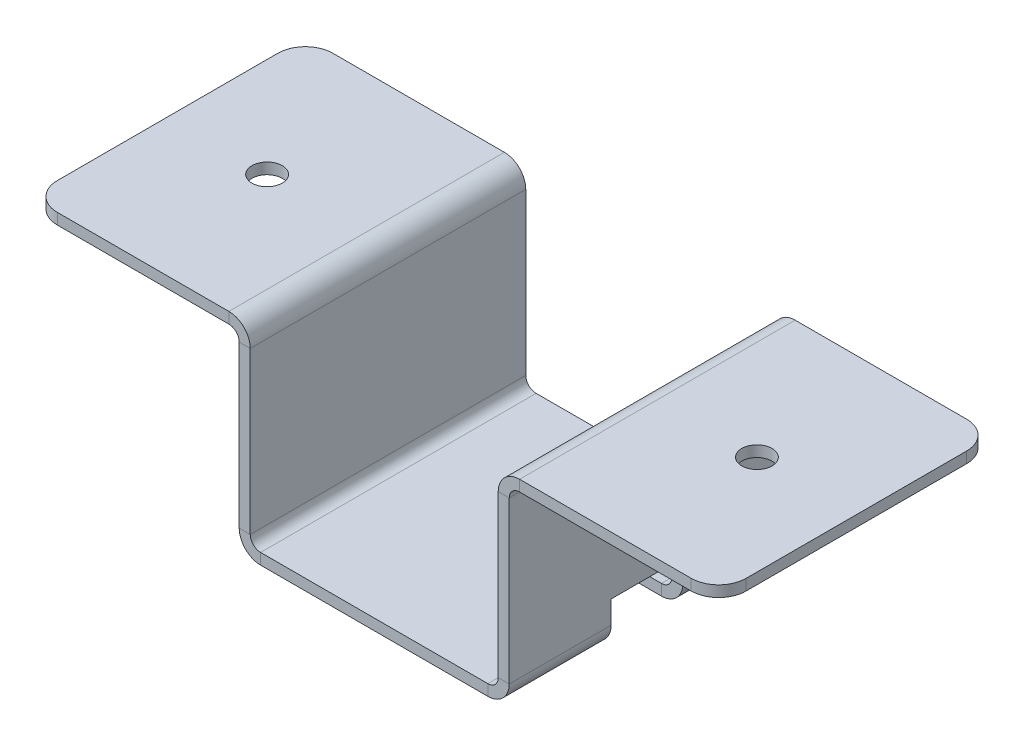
ISO-10303-21;
HEADER;
FILE_DESCRIPTION(('STEP AP214'),'2;1');
FILE_NAME('part.step','',(''),(''),'','','');
FILE_SCHEMA(('AUTOMOTIVE_DESIGN { 1 0 10303 214 1 1 1 1 }'));
ENDSEC;
DATA;
#1=APPLICATION_CONTEXT('core data for automotive mechanical design processes');
#2=APPLICATION_PROTOCOL_DEFINITION('international standard','automotive_design',2000,#1);
#3=PRODUCT_CONTEXT('',#1,'mechanical');
#4=PRODUCT('Part','Part','',(#3));
#5=PRODUCT_RELATED_PRODUCT_CATEGORY('part','',(#4));
#6=PRODUCT_DEFINITION_FORMATION('','',#4);
#7=PRODUCT_DEFINITION_CONTEXT('part definition',#1,'design');
#8=PRODUCT_DEFINITION('design','',#6,#7);
#9=PRODUCT_DEFINITION_SHAPE('','',#8);
#10=(LENGTH_UNIT() NAMED_UNIT(*) SI_UNIT(.MILLI.,.METRE.));
#11=(NAMED_UNIT(*) PLANE_ANGLE_UNIT() SI_UNIT($,.RADIAN.));
#12=(NAMED_UNIT(*) SI_UNIT($,.STERADIAN.) SOLID_ANGLE_UNIT());
#13=UNCERTAINTY_MEASURE_WITH_UNIT(LENGTH_MEASURE(1.E-05),#10,'distance_accuracy_value','');
#14=(GEOMETRIC_REPRESENTATION_CONTEXT(3) GLOBAL_UNCERTAINTY_ASSIGNED_CONTEXT((#13)) GLOBAL_UNIT_ASSIGNED_CONTEXT((#10,
#11,#12)) REPRESENTATION_CONTEXT('',''));
#15=CARTESIAN_POINT('',(0.,0.,0.));
#16=DIRECTION('',(0.,0.,1.));
#17=DIRECTION('',(1.,0.,0.));
#18=AXIS2_PLACEMENT_3D('',#15,#16,#17);
#19=CARTESIAN_POINT('',(16.5,6.,18.5));
#20=DIRECTION('',(0.,0.,-1.));
#21=DIRECTION('',(-1.,0.,0.));
#22=AXIS2_PLACEMENT_3D('',#19,#20,#21);
#23=PLANE('',#22);
#24=DIRECTION('',(0.,1.,0.));
#25=VECTOR('',#24,1.);
#26=CARTESIAN_POINT('',(22.5,0.,18.5));
#27=LINE('',#26,#25);
#28=CARTESIAN_POINT('',(22.5,1.88,18.5));
#29=VERTEX_POINT('',#28);
#30=CARTESIAN_POINT('',(22.5,6.,18.5));
#31=VERTEX_POINT('',#30);
#32=EDGE_CURVE('E289',#29,#31,#27,.T.);
#33=ORIENTED_EDGE('',*,*,#32,.F.);
#34=DIRECTION('',(1.,0.,0.));
#35=VECTOR('',#34,1.);
#36=CARTESIAN_POINT('',(22.5,1.88,18.5));
#37=LINE('',#36,#35);
#38=CARTESIAN_POINT('',(24.5,1.88,18.5));
#39=VERTEX_POINT('',#38);
#40=EDGE_CURVE('E528',#29,#39,#37,.T.);
#41=ORIENTED_EDGE('',*,*,#40,.T.);
#42=DIRECTION('',(0.,1.,0.));
#43=VECTOR('',#42,1.);
#44=CARTESIAN_POINT('',(24.5,0.,18.5));
#45=LINE('',#44,#43);
#46=CARTESIAN_POINT('',(24.5,6.,18.5));
#47=VERTEX_POINT('',#46);
#48=EDGE_CURVE('E292',#39,#47,#45,.T.);
#49=ORIENTED_EDGE('',*,*,#48,.T.);
#50=DIRECTION('',(1.,0.,0.));
#51=VECTOR('',#50,1.);
#52=CARTESIAN_POINT('',(16.5,6.,18.5));
#53=LINE('',#52,#51);
#54=EDGE_CURVE('E281',#31,#47,#53,.T.);
#55=ORIENTED_EDGE('',*,*,#54,.F.);
#56=EDGE_LOOP('',(#33,#41,#49,#55));
#57=FACE_BOUND('',#56,.T.);
#58=ADVANCED_FACE('F43',(#57),#23,.F.);
#59=DIRECTION('',(1.,0.,0.));
#60=VECTOR('',#59,1.);
#61=CARTESIAN_POINT('',(16.5,-2.,18.5));
#62=LINE('',#61,#60);
#63=CARTESIAN_POINT('',(16.5,-2.,18.5));
#64=VERTEX_POINT('',#63);
#65=CARTESIAN_POINT('',(20.62,-2.,18.5));
#66=VERTEX_POINT('',#65);
#67=EDGE_CURVE('E258',#64,#66,#62,.T.);
#68=ORIENTED_EDGE('',*,*,#67,.T.);
#69=DIRECTION('',(0.,1.,0.));
#70=VECTOR('',#69,1.);
#71=CARTESIAN_POINT('',(20.62,-2.,18.5));
#72=LINE('',#71,#70);
#73=CARTESIAN_POINT('',(20.62,0.,18.5));
#74=VERTEX_POINT('',#73);
#75=EDGE_CURVE('E526',#66,#74,#72,.T.);
#76=ORIENTED_EDGE('',*,*,#75,.T.);
#77=DIRECTION('',(1.,0.,0.));
#78=VECTOR('',#77,1.);
#79=CARTESIAN_POINT('',(-22.5,0.,18.5));
#80=LINE('',#79,#78);
#81=CARTESIAN_POINT('',(16.5,0.,18.5));
#82=VERTEX_POINT('',#81);
#83=EDGE_CURVE('E261',#82,#74,#80,.T.);
#84=ORIENTED_EDGE('',*,*,#83,.F.);
#85=DIRECTION('',(0.,-1.,0.));
#86=VECTOR('',#85,1.);
#87=CARTESIAN_POINT('',(16.5,6.,18.5));
#88=LINE('',#87,#86);
#89=EDGE_CURVE('E254',#82,#64,#88,.T.);
#90=ORIENTED_EDGE('',*,*,#89,.T.);
#91=EDGE_LOOP('',(#68,#76,#84,#90));
#92=FACE_BOUND('',#91,.T.);
#93=ADVANCED_FACE('F256',(#92),#23,.F.);
#94=CARTESIAN_POINT('',(16.5,6.,31.5));
#95=DIRECTION('',(0.,0.,1.));
#96=DIRECTION('',(1.,0.,0.));
#97=AXIS2_PLACEMENT_3D('',#94,#95,#96);
#98=PLANE('',#97);
#99=DIRECTION('',(-1.,0.,0.));
#100=VECTOR('',#99,1.);
#101=CARTESIAN_POINT('',(-22.5,0.,31.5));
#102=LINE('',#101,#100);
#103=CARTESIAN_POINT('',(20.62,0.,31.5));
#104=VERTEX_POINT('',#103);
#105=CARTESIAN_POINT('',(16.5,0.,31.5));
#106=VERTEX_POINT('',#105);
#107=EDGE_CURVE('E517',#104,#106,#102,.T.);
#108=ORIENTED_EDGE('',*,*,#107,.F.);
#109=DIRECTION('',(0.,-1.,0.));
#110=VECTOR('',#109,1.);
#111=CARTESIAN_POINT('',(20.62,0.,31.5));
#112=LINE('',#111,#110);
#113=CARTESIAN_POINT('',(20.62,-2.,31.5));
#114=VERTEX_POINT('',#113);
#115=EDGE_CURVE('E524',#104,#114,#112,.T.);
#116=ORIENTED_EDGE('',*,*,#115,.T.);
#117=DIRECTION('',(-1.,0.,0.));
#118=VECTOR('',#117,1.);
#119=CARTESIAN_POINT('',(16.5,-2.,31.5));
#120=LINE('',#119,#118);
#121=CARTESIAN_POINT('',(16.5,-2.,31.5));
#122=VERTEX_POINT('',#121);
#123=EDGE_CURVE('E279',#114,#122,#120,.T.);
#124=ORIENTED_EDGE('',*,*,#123,.T.);
#125=DIRECTION('',(0.,-1.,0.));
#126=VECTOR('',#125,1.);
#127=CARTESIAN_POINT('',(16.5,6.,31.5));
#128=LINE('',#127,#126);
#129=EDGE_CURVE('E264',#106,#122,#128,.T.);
#130=ORIENTED_EDGE('',*,*,#129,.F.);
#131=EDGE_LOOP('',(#108,#116,#124,#130));
#132=FACE_BOUND('',#131,.T.);
#133=ADVANCED_FACE('F695',(#132),#98,.F.);
#134=DIRECTION('',(0.,-1.,0.));
#135=VECTOR('',#134,1.);
#136=CARTESIAN_POINT('',(24.5,0.,31.5));
#137=LINE('',#136,#135);
#138=CARTESIAN_POINT('',(24.5,6.,31.5));
#139=VERTEX_POINT('',#138);
#140=CARTESIAN_POINT('',(24.5,1.88,31.5));
#141=VERTEX_POINT('',#140);
#142=EDGE_CURVE('E304',#139,#141,#137,.T.);
#143=ORIENTED_EDGE('',*,*,#142,.T.);
#144=DIRECTION('',(-1.,0.,0.));
#145=VECTOR('',#144,1.);
#146=CARTESIAN_POINT('',(24.5,1.88,31.5));
#147=LINE('',#146,#145);
#148=CARTESIAN_POINT('',(22.5,1.88,31.5));
#149=VERTEX_POINT('',#148);
#150=EDGE_CURVE('E522',#141,#149,#147,.T.);
#151=ORIENTED_EDGE('',*,*,#150,.T.);
#152=DIRECTION('',(0.,-1.,0.));
#153=VECTOR('',#152,1.);
#154=CARTESIAN_POINT('',(22.5,0.,31.5));
#155=LINE('',#154,#153);
#156=CARTESIAN_POINT('',(22.5,6.,31.5));
#157=VERTEX_POINT('',#156);
#158=EDGE_CURVE('E301',#157,#149,#155,.T.);
#159=ORIENTED_EDGE('',*,*,#158,.F.);
#160=DIRECTION('',(-1.,0.,0.));
#161=VECTOR('',#160,1.);
#162=CARTESIAN_POINT('',(16.5,6.,31.5));
#163=LINE('',#162,#161);
#164=EDGE_CURVE('E265',#139,#157,#163,.T.);
#165=ORIENTED_EDGE('',*,*,#164,.F.);
#166=EDGE_LOOP('',(#143,#151,#159,#165));
#167=FACE_BOUND('',#166,.T.);
#168=ADVANCED_FACE('F709',(#167),#98,.F.);
#169=CARTESIAN_POINT('',(20.62,1.88,50.));
#170=DIRECTION('',(0.,0.,-1.));
#171=DIRECTION('',(-1.,0.,0.));
#172=AXIS2_PLACEMENT_3D('',#169,#170,#171);
#173=CYLINDRICAL_SURFACE('',#172,3.88);
#174=CARTESIAN_POINT('',(20.62,1.88,31.5));
#175=DIRECTION('',(0.,0.,1.));
#176=DIRECTION('',(1.,0.,0.));
#177=AXIS2_PLACEMENT_3D('',#174,#175,#176);
#178=CIRCLE('',#177,3.88);
#179=EDGE_CURVE('E307',#141,#114,#178,.F.);
#180=ORIENTED_EDGE('',*,*,#179,.F.);
#181=DIRECTION('',(0.,0.,-1.));
#182=VECTOR('',#181,1.);
#183=CARTESIAN_POINT('',(24.5,1.88,50.));
#184=LINE('',#183,#182);
#185=CARTESIAN_POINT('',(24.5,1.88,50.));
#186=VERTEX_POINT('',#185);
#187=EDGE_CURVE('E454',#186,#141,#184,.T.);
#188=ORIENTED_EDGE('',*,*,#187,.F.);
#189=CARTESIAN_POINT('',(20.62,1.88,50.));
#190=DIRECTION('',(0.,0.,1.));
#191=DIRECTION('',(1.,0.,0.));
#192=AXIS2_PLACEMENT_3D('',#189,#190,#191);
#193=CIRCLE('',#192,3.88);
#194=CARTESIAN_POINT('',(20.62,-2.,50.));
#195=VERTEX_POINT('',#194);
#196=EDGE_CURVE('E333',#186,#195,#193,.F.);
#197=ORIENTED_EDGE('',*,*,#196,.T.);
#198=DIRECTION('',(0.,0.,-1.));
#199=VECTOR('',#198,1.);
#200=CARTESIAN_POINT('',(20.62,-2.,50.));
#201=LINE('',#200,#199);
#202=EDGE_CURVE('E457',#195,#114,#201,.T.);
#203=ORIENTED_EDGE('',*,*,#202,.T.);
#204=EDGE_LOOP('',(#180,#188,#197,#203));
#205=FACE_BOUND('',#204,.T.);
#206=ADVANCED_FACE('F606',(#205),#173,.T.);
#207=CARTESIAN_POINT('',(20.62,1.88,50.));
#208=DIRECTION('',(0.,0.,-1.));
#209=DIRECTION('',(-1.,0.,0.));
#210=AXIS2_PLACEMENT_3D('',#207,#208,#209);
#211=CYLINDRICAL_SURFACE('',#210,1.88);
#212=DIRECTION('',(0.,0.,-1.));
#213=VECTOR('',#212,1.);
#214=CARTESIAN_POINT('',(22.5,1.88,50.));
#215=LINE('',#214,#213);
#216=CARTESIAN_POINT('',(22.5,1.88,50.));
#217=VERTEX_POINT('',#216);
#218=EDGE_CURVE('E434',#217,#149,#215,.T.);
#219=ORIENTED_EDGE('',*,*,#218,.T.);
#220=CARTESIAN_POINT('',(20.62,1.88,31.5));
#221=DIRECTION('',(0.,0.,1.));
#222=DIRECTION('',(1.,0.,0.));
#223=AXIS2_PLACEMENT_3D('',#220,#221,#222);
#224=CIRCLE('',#223,1.88);
#225=EDGE_CURVE('E298',#149,#104,#224,.F.);
#226=ORIENTED_EDGE('',*,*,#225,.T.);
#227=DIRECTION('',(0.,0.,-1.));
#228=VECTOR('',#227,1.);
#229=CARTESIAN_POINT('',(20.62,0.,50.));
#230=LINE('',#229,#228);
#231=CARTESIAN_POINT('',(20.62,0.,50.));
#232=VERTEX_POINT('',#231);
#233=EDGE_CURVE('E430',#232,#104,#230,.T.);
#234=ORIENTED_EDGE('',*,*,#233,.F.);
#235=CARTESIAN_POINT('',(20.62,1.88,50.));
#236=DIRECTION('',(0.,0.,1.));
#237=DIRECTION('',(1.,0.,0.));
#238=AXIS2_PLACEMENT_3D('',#235,#236,#237);
#239=CIRCLE('',#238,1.88);
#240=EDGE_CURVE('E352',#217,#232,#239,.F.);
#241=ORIENTED_EDGE('',*,*,#240,.F.);
#242=EDGE_LOOP('',(#219,#226,#234,#241));
#243=FACE_BOUND('',#242,.T.);
#244=ADVANCED_FACE('F756',(#243),#211,.F.);
#245=CARTESIAN_POINT('',(26.38,35.,50.));
#246=DIRECTION('',(0.,0.,1.));
#247=DIRECTION('',(1.,0.,0.));
#248=AXIS2_PLACEMENT_3D('',#245,#246,#247);
#249=PLANE('',#248);
#250=DIRECTION('',(0.,-1.,0.));
#251=VECTOR('',#250,1.);
#252=CARTESIAN_POINT('',(26.38,35.,50.));
#253=LINE('',#252,#251);
#254=CARTESIAN_POINT('',(26.38,35.,50.));
#255=VERTEX_POINT('',#254);
#256=CARTESIAN_POINT('',(26.38,33.,50.));
#257=VERTEX_POINT('',#256);
#258=EDGE_CURVE('E511',#255,#257,#253,.T.);
#259=ORIENTED_EDGE('',*,*,#258,.F.);
#260=CARTESIAN_POINT('',(26.38,31.12,50.));
#261=DIRECTION('',(0.,0.,-1.));
#262=DIRECTION('',(-1.,0.,0.));
#263=AXIS2_PLACEMENT_3D('',#260,#261,#262);
#264=CIRCLE('',#263,3.88);
#265=CARTESIAN_POINT('',(22.5,31.12,50.));
#266=VERTEX_POINT('',#265);
#267=EDGE_CURVE('E346',#255,#266,#264,.F.);
#268=ORIENTED_EDGE('',*,*,#267,.T.);
#269=DIRECTION('',(-1.,0.,0.));
#270=VECTOR('',#269,1.);
#271=CARTESIAN_POINT('',(24.5,31.12,50.));
#272=LINE('',#271,#270);
#273=CARTESIAN_POINT('',(24.5,31.12,50.));
#274=VERTEX_POINT('',#273);
#275=EDGE_CURVE('E509',#274,#266,#272,.T.);
#276=ORIENTED_EDGE('',*,*,#275,.F.);
#277=CARTESIAN_POINT('',(26.38,31.12,50.));
#278=DIRECTION('',(0.,0.,1.));
#279=DIRECTION('',(1.,0.,0.));
#280=AXIS2_PLACEMENT_3D('',#277,#278,#279);
#281=CIRCLE('',#280,1.88);
#282=EDGE_CURVE('E339',#257,#274,#281,.T.);
#283=ORIENTED_EDGE('',*,*,#282,.F.);
#284=EDGE_LOOP('',(#259,#268,#276,#283));
#285=FACE_BOUND('',#284,.T.);
#286=ADVANCED_FACE('F588',(#285),#249,.T.);
#287=CARTESIAN_POINT('',(24.5,31.12,50.));
#288=DIRECTION('',(0.,0.,1.));
#289=DIRECTION('',(1.,0.,0.));
#290=AXIS2_PLACEMENT_3D('',#287,#288,#289);
#291=PLANE('',#290);
#292=DIRECTION('',(1.,0.,0.));
#293=VECTOR('',#292,1.);
#294=CARTESIAN_POINT('',(22.5,33.,50.));
#295=LINE('',#294,#293);
#296=CARTESIAN_POINT('',(57.5,33.,50.));
#297=VERTEX_POINT('',#296);
#298=EDGE_CURVE('E342',#297,#257,#295,.F.);
#299=ORIENTED_EDGE('',*,*,#298,.F.);
#300=DIRECTION('',(0.,-1.,0.));
#301=VECTOR('',#300,1.);
#302=CARTESIAN_POINT('',(57.5,31.12,50.));
#303=LINE('',#302,#301);
#304=CARTESIAN_POINT('',(57.5,35.,50.));
#305=VERTEX_POINT('',#304);
#306=EDGE_CURVE('E11',#297,#305,#303,.F.);
#307=ORIENTED_EDGE('',*,*,#306,.T.);
#308=DIRECTION('',(-1.,0.,0.));
#309=VECTOR('',#308,1.);
#310=CARTESIAN_POINT('',(22.5,35.,50.));
#311=LINE('',#310,#309);
#312=EDGE_CURVE('E344',#305,#255,#311,.T.);
#313=ORIENTED_EDGE('',*,*,#312,.T.);
#314=ORIENTED_EDGE('',*,*,#258,.T.);
#315=EDGE_LOOP('',(#299,#307,#313,#314));
#316=FACE_BOUND('',#315,.T.);
#317=ADVANCED_FACE('F580',(#316),#291,.T.);
#318=CARTESIAN_POINT('',(22.5,31.12,0.));
#319=DIRECTION('',(0.,0.,-1.));
#320=DIRECTION('',(-1.,0.,0.));
#321=AXIS2_PLACEMENT_3D('',#318,#319,#320);
#322=PLANE('',#321);
#323=DIRECTION('',(1.,0.,0.));
#324=VECTOR('',#323,1.);
#325=CARTESIAN_POINT('',(22.5,31.12,0.));
#326=LINE('',#325,#324);
#327=CARTESIAN_POINT('',(22.5,31.12,0.));
#328=VERTEX_POINT('',#327);
#329=CARTESIAN_POINT('',(24.5,31.12,0.));
#330=VERTEX_POINT('',#329);
#331=EDGE_CURVE('E507',#328,#330,#326,.T.);
#332=ORIENTED_EDGE('',*,*,#331,.F.);
#333=CARTESIAN_POINT('',(26.38,31.12,0.));
#334=DIRECTION('',(0.,0.,-1.));
#335=DIRECTION('',(-1.,0.,0.));
#336=AXIS2_PLACEMENT_3D('',#333,#334,#335);
#337=CIRCLE('',#336,3.88);
#338=CARTESIAN_POINT('',(26.38,35.,0.));
#339=VERTEX_POINT('',#338);
#340=EDGE_CURVE('E398',#339,#328,#337,.F.);
#341=ORIENTED_EDGE('',*,*,#340,.F.);
#342=DIRECTION('',(0.,1.,0.));
#343=VECTOR('',#342,1.);
#344=CARTESIAN_POINT('',(26.38,33.,0.));
#345=LINE('',#344,#343);
#346=CARTESIAN_POINT('',(26.38,33.,0.));
#347=VERTEX_POINT('',#346);
#348=EDGE_CURVE('E504',#347,#339,#345,.T.);
#349=ORIENTED_EDGE('',*,*,#348,.F.);
#350=CARTESIAN_POINT('',(26.38,31.12,0.));
#351=DIRECTION('',(0.,0.,1.));
#352=DIRECTION('',(1.,0.,0.));
#353=AXIS2_PLACEMENT_3D('',#350,#351,#352);
#354=CIRCLE('',#353,1.88);
#355=EDGE_CURVE('E391',#347,#330,#354,.T.);
#356=ORIENTED_EDGE('',*,*,#355,.T.);
#357=EDGE_LOOP('',(#332,#341,#349,#356));
#358=FACE_BOUND('',#357,.T.);
#359=ADVANCED_FACE('F817',(#358),#322,.T.);
#360=CARTESIAN_POINT('',(26.38,33.,0.));
#361=DIRECTION('',(0.,0.,-1.));
#362=DIRECTION('',(-1.,0.,0.));
#363=AXIS2_PLACEMENT_3D('',#360,#361,#362);
#364=PLANE('',#363);
#365=DIRECTION('',(0.,-1.,0.));
#366=VECTOR('',#365,1.);
#367=CARTESIAN_POINT('',(22.5,0.,0.));
#368=LINE('',#367,#366);
#369=CARTESIAN_POINT('',(22.5,1.88,0.));
#370=VERTEX_POINT('',#369);
#371=EDGE_CURVE('E401',#328,#370,#368,.T.);
#372=ORIENTED_EDGE('',*,*,#371,.F.);
#373=ORIENTED_EDGE('',*,*,#331,.T.);
#374=DIRECTION('',(0.,1.,0.));
#375=VECTOR('',#374,1.);
#376=CARTESIAN_POINT('',(24.5,0.,0.));
#377=LINE('',#376,#375);
#378=CARTESIAN_POINT('',(24.5,1.88,0.));
#379=VERTEX_POINT('',#378);
#380=EDGE_CURVE('E388',#330,#379,#377,.F.);
#381=ORIENTED_EDGE('',*,*,#380,.T.);
#382=DIRECTION('',(-1.,0.,0.));
#383=VECTOR('',#382,1.);
#384=CARTESIAN_POINT('',(24.5,1.88,0.));
#385=LINE('',#384,#383);
#386=EDGE_CURVE('E494',#379,#370,#385,.T.);
#387=ORIENTED_EDGE('',*,*,#386,.T.);
#388=EDGE_LOOP('',(#372,#373,#381,#387));
#389=FACE_BOUND('',#388,.T.);
#390=ADVANCED_FACE('F814',(#389),#364,.T.);
#391=CARTESIAN_POINT('',(22.5,1.88,50.));
#392=DIRECTION('',(0.,0.,1.));
#393=DIRECTION('',(1.,0.,0.));
#394=AXIS2_PLACEMENT_3D('',#391,#392,#393);
#395=PLANE('',#394);
#396=DIRECTION('',(1.,0.,0.));
#397=VECTOR('',#396,1.);
#398=CARTESIAN_POINT('',(22.5,1.88,50.));
#399=LINE('',#398,#397);
#400=EDGE_CURVE('E502',#217,#186,#399,.T.);
#401=ORIENTED_EDGE('',*,*,#400,.F.);
#402=ORIENTED_EDGE('',*,*,#240,.T.);
#403=DIRECTION('',(0.,1.,0.));
#404=VECTOR('',#403,1.);
#405=CARTESIAN_POINT('',(20.62,-2.,50.));
#406=LINE('',#405,#404);
#407=EDGE_CURVE('E500',#195,#232,#406,.T.);
#408=ORIENTED_EDGE('',*,*,#407,.F.);
#409=ORIENTED_EDGE('',*,*,#196,.F.);
#410=EDGE_LOOP('',(#401,#402,#408,#409));
#411=FACE_BOUND('',#410,.T.);
#412=ADVANCED_FACE('F607',(#411),#395,.T.);
#413=CARTESIAN_POINT('',(20.62,-2.,50.));
#414=DIRECTION('',(0.,0.,1.));
#415=DIRECTION('',(1.,0.,0.));
#416=AXIS2_PLACEMENT_3D('',#413,#414,#415);
#417=PLANE('',#416);
#418=DIRECTION('',(0.,-1.,0.));
#419=VECTOR('',#418,1.);
#420=CARTESIAN_POINT('',(22.5,0.,50.));
#421=LINE('',#420,#419);
#422=EDGE_CURVE('E349',#266,#217,#421,.T.);
#423=ORIENTED_EDGE('',*,*,#422,.T.);
#424=ORIENTED_EDGE('',*,*,#400,.T.);
#425=DIRECTION('',(0.,1.,0.));
#426=VECTOR('',#425,1.);
#427=CARTESIAN_POINT('',(24.5,0.,50.));
#428=LINE('',#427,#426);
#429=EDGE_CURVE('E336',#274,#186,#428,.F.);
#430=ORIENTED_EDGE('',*,*,#429,.F.);
#431=ORIENTED_EDGE('',*,*,#275,.T.);
#432=EDGE_LOOP('',(#423,#424,#430,#431));
#433=FACE_BOUND('',#432,.T.);
#434=ADVANCED_FACE('F598',(#433),#417,.T.);
#435=CARTESIAN_POINT('',(20.62,0.,0.));
#436=DIRECTION('',(0.,0.,-1.));
#437=DIRECTION('',(-1.,0.,0.));
#438=AXIS2_PLACEMENT_3D('',#435,#436,#437);
#439=PLANE('',#438);
#440=DIRECTION('',(0.,-1.,0.));
#441=VECTOR('',#440,1.);
#442=CARTESIAN_POINT('',(20.62,0.,0.));
#443=LINE('',#442,#441);
#444=CARTESIAN_POINT('',(20.62,0.,0.));
#445=VERTEX_POINT('',#444);
#446=CARTESIAN_POINT('',(20.62,-2.,0.));
#447=VERTEX_POINT('',#446);
#448=EDGE_CURVE('E497',#445,#447,#443,.T.);
#449=ORIENTED_EDGE('',*,*,#448,.F.);
#450=CARTESIAN_POINT('',(20.62,1.88,0.));
#451=DIRECTION('',(0.,0.,1.));
#452=DIRECTION('',(1.,0.,0.));
#453=AXIS2_PLACEMENT_3D('',#450,#451,#452);
#454=CIRCLE('',#453,1.88);
#455=EDGE_CURVE('E404',#370,#445,#454,.F.);
#456=ORIENTED_EDGE('',*,*,#455,.F.);
#457=ORIENTED_EDGE('',*,*,#386,.F.);
#458=CARTESIAN_POINT('',(20.62,1.88,0.));
#459=DIRECTION('',(0.,0.,1.));
#460=DIRECTION('',(1.,0.,0.));
#461=AXIS2_PLACEMENT_3D('',#458,#459,#460);
#462=CIRCLE('',#461,3.88);
#463=EDGE_CURVE('E385',#379,#447,#462,.F.);
#464=ORIENTED_EDGE('',*,*,#463,.T.);
#465=EDGE_LOOP('',(#449,#456,#457,#464));
#466=FACE_BOUND('',#465,.T.);
#467=ADVANCED_FACE('F726',(#466),#439,.T.);
#468=CARTESIAN_POINT('',(24.5,1.88,0.));
#469=DIRECTION('',(0.,0.,-1.));
#470=DIRECTION('',(-1.,0.,0.));
#471=AXIS2_PLACEMENT_3D('',#468,#469,#470);
#472=PLANE('',#471);
#473=DIRECTION('',(-1.,0.,0.));
#474=VECTOR('',#473,1.);
#475=CARTESIAN_POINT('',(-22.5,0.,0.));
#476=LINE('',#475,#474);
#477=CARTESIAN_POINT('',(-20.62,0.,0.));
#478=VERTEX_POINT('',#477);
#479=EDGE_CURVE('E407',#445,#478,#476,.T.);
#480=ORIENTED_EDGE('',*,*,#479,.F.);
#481=ORIENTED_EDGE('',*,*,#448,.T.);
#482=DIRECTION('',(1.,0.,0.));
#483=VECTOR('',#482,1.);
#484=CARTESIAN_POINT('',(-22.5,-2.,0.));
#485=LINE('',#484,#483);
#486=CARTESIAN_POINT('',(-20.62,-2.,0.));
#487=VERTEX_POINT('',#486);
#488=EDGE_CURVE('E382',#447,#487,#485,.F.);
#489=ORIENTED_EDGE('',*,*,#488,.T.);
#490=DIRECTION('',(0.,1.,0.));
#491=VECTOR('',#490,1.);
#492=CARTESIAN_POINT('',(-20.62,-2.,0.));
#493=LINE('',#492,#491);
#494=EDGE_CURVE('E486',#487,#478,#493,.T.);
#495=ORIENTED_EDGE('',*,*,#494,.T.);
#496=EDGE_LOOP('',(#480,#481,#489,#495));
#497=FACE_BOUND('',#496,.T.);
#498=ADVANCED_FACE('F730',(#497),#472,.T.);
#499=CARTESIAN_POINT('',(-20.62,0.,50.));
#500=DIRECTION('',(0.,0.,1.));
#501=DIRECTION('',(1.,0.,0.));
#502=AXIS2_PLACEMENT_3D('',#499,#500,#501);
#503=PLANE('',#502);
#504=DIRECTION('',(0.,-1.,0.));
#505=VECTOR('',#504,1.);
#506=CARTESIAN_POINT('',(-20.62,0.,50.));
#507=LINE('',#506,#505);
#508=CARTESIAN_POINT('',(-20.62,0.,50.));
#509=VERTEX_POINT('',#508);
#510=CARTESIAN_POINT('',(-20.62,-2.,50.));
#511=VERTEX_POINT('',#510);
#512=EDGE_CURVE('E492',#509,#511,#507,.T.);
#513=ORIENTED_EDGE('',*,*,#512,.F.);
#514=CARTESIAN_POINT('',(-20.62,1.88,50.));
#515=DIRECTION('',(0.,0.,1.));
#516=DIRECTION('',(1.,0.,0.));
#517=AXIS2_PLACEMENT_3D('',#514,#515,#516);
#518=CIRCLE('',#517,1.88);
#519=CARTESIAN_POINT('',(-22.5,1.88,50.));
#520=VERTEX_POINT('',#519);
#521=EDGE_CURVE('E358',#509,#520,#518,.F.);
#522=ORIENTED_EDGE('',*,*,#521,.T.);
#523=DIRECTION('',(1.,0.,0.));
#524=VECTOR('',#523,1.);
#525=CARTESIAN_POINT('',(-24.5,1.88,50.));
#526=LINE('',#525,#524);
#527=CARTESIAN_POINT('',(-24.5,1.88,50.));
#528=VERTEX_POINT('',#527);
#529=EDGE_CURVE('E490',#528,#520,#526,.T.);
#530=ORIENTED_EDGE('',*,*,#529,.F.);
#531=CARTESIAN_POINT('',(-20.62,1.88,50.));
#532=DIRECTION('',(0.,0.,1.));
#533=DIRECTION('',(1.,0.,0.));
#534=AXIS2_PLACEMENT_3D('',#531,#532,#533);
#535=CIRCLE('',#534,3.88);
#536=EDGE_CURVE('E327',#511,#528,#535,.F.);
#537=ORIENTED_EDGE('',*,*,#536,.F.);
#538=EDGE_LOOP('',(#513,#522,#530,#537));
#539=FACE_BOUND('',#538,.T.);
#540=ADVANCED_FACE('F622',(#539),#503,.T.);
#541=CARTESIAN_POINT('',(-24.5,1.88,50.));
#542=DIRECTION('',(0.,0.,1.));
#543=DIRECTION('',(1.,0.,0.));
#544=AXIS2_PLACEMENT_3D('',#541,#542,#543);
#545=PLANE('',#544);
#546=DIRECTION('',(-1.,0.,0.));
#547=VECTOR('',#546,1.);
#548=CARTESIAN_POINT('',(-22.5,0.,50.));
#549=LINE('',#548,#547);
#550=EDGE_CURVE('E355',#232,#509,#549,.T.);
#551=ORIENTED_EDGE('',*,*,#550,.T.);
#552=ORIENTED_EDGE('',*,*,#512,.T.);
#553=DIRECTION('',(1.,0.,0.));
#554=VECTOR('',#553,1.);
#555=CARTESIAN_POINT('',(-22.5,-2.,50.));
#556=LINE('',#555,#554);
#557=EDGE_CURVE('E330',#195,#511,#556,.F.);
#558=ORIENTED_EDGE('',*,*,#557,.F.);
#559=ORIENTED_EDGE('',*,*,#407,.T.);
#560=EDGE_LOOP('',(#551,#552,#558,#559));
#561=FACE_BOUND('',#560,.T.);
#562=ADVANCED_FACE('F613',(#561),#545,.T.);
#563=CARTESIAN_POINT('',(-22.5,1.88,0.));
#564=DIRECTION('',(0.,0.,-1.));
#565=DIRECTION('',(-1.,0.,0.));
#566=AXIS2_PLACEMENT_3D('',#563,#564,#565);
#567=PLANE('',#566);
#568=DIRECTION('',(-1.,0.,0.));
#569=VECTOR('',#568,1.);
#570=CARTESIAN_POINT('',(-22.5,1.88,0.));
#571=LINE('',#570,#569);
#572=CARTESIAN_POINT('',(-22.5,1.88,0.));
#573=VERTEX_POINT('',#572);
#574=CARTESIAN_POINT('',(-24.5,1.88,0.));
#575=VERTEX_POINT('',#574);
#576=EDGE_CURVE('E488',#573,#575,#571,.T.);
#577=ORIENTED_EDGE('',*,*,#576,.F.);
#578=CARTESIAN_POINT('',(-20.62,1.88,0.));
#579=DIRECTION('',(0.,0.,1.));
#580=DIRECTION('',(1.,0.,0.));
#581=AXIS2_PLACEMENT_3D('',#578,#579,#580);
#582=CIRCLE('',#581,1.88);
#583=EDGE_CURVE('E410',#478,#573,#582,.F.);
#584=ORIENTED_EDGE('',*,*,#583,.F.);
#585=ORIENTED_EDGE('',*,*,#494,.F.);
#586=CARTESIAN_POINT('',(-20.62,1.88,0.));
#587=DIRECTION('',(0.,0.,1.));
#588=DIRECTION('',(1.,0.,0.));
#589=AXIS2_PLACEMENT_3D('',#586,#587,#588);
#590=CIRCLE('',#589,3.88);
#591=EDGE_CURVE('E379',#487,#575,#590,.F.);
#592=ORIENTED_EDGE('',*,*,#591,.T.);
#593=EDGE_LOOP('',(#577,#584,#585,#592));
#594=FACE_BOUND('',#593,.T.);
#595=ADVANCED_FACE('F737',(#594),#567,.T.);
#596=CARTESIAN_POINT('',(-20.62,-2.,0.));
#597=DIRECTION('',(0.,0.,-1.));
#598=DIRECTION('',(-1.,0.,0.));
#599=AXIS2_PLACEMENT_3D('',#596,#597,#598);
#600=PLANE('',#599);
#601=DIRECTION('',(0.,1.,0.));
#602=VECTOR('',#601,1.);
#603=CARTESIAN_POINT('',(-22.5,0.,0.));
#604=LINE('',#603,#602);
#605=CARTESIAN_POINT('',(-22.5,31.12,0.));
#606=VERTEX_POINT('',#605);
#607=EDGE_CURVE('E413',#573,#606,#604,.T.);
#608=ORIENTED_EDGE('',*,*,#607,.F.);
#609=ORIENTED_EDGE('',*,*,#576,.T.);
#610=DIRECTION('',(0.,1.,0.));
#611=VECTOR('',#610,1.);
#612=CARTESIAN_POINT('',(-24.5,0.,0.));
#613=LINE('',#612,#611);
#614=CARTESIAN_POINT('',(-24.5,31.12,0.));
#615=VERTEX_POINT('',#614);
#616=EDGE_CURVE('E376',#575,#615,#613,.T.);
#617=ORIENTED_EDGE('',*,*,#616,.T.);
#618=DIRECTION('',(1.,0.,0.));
#619=VECTOR('',#618,1.);
#620=CARTESIAN_POINT('',(-24.5,31.12,0.));
#621=LINE('',#620,#619);
#622=EDGE_CURVE('E478',#615,#606,#621,.T.);
#623=ORIENTED_EDGE('',*,*,#622,.T.);
#624=EDGE_LOOP('',(#608,#609,#617,#623));
#625=FACE_BOUND('',#624,.T.);
#626=ADVANCED_FACE('F740',(#625),#600,.T.);
#627=CARTESIAN_POINT('',(-22.5,31.12,50.));
#628=DIRECTION('',(0.,0.,1.));
#629=DIRECTION('',(1.,0.,0.));
#630=AXIS2_PLACEMENT_3D('',#627,#628,#629);
#631=PLANE('',#630);
#632=DIRECTION('',(-1.,0.,0.));
#633=VECTOR('',#632,1.);
#634=CARTESIAN_POINT('',(-22.5,31.12,50.));
#635=LINE('',#634,#633);
#636=CARTESIAN_POINT('',(-22.5,31.12,50.));
#637=VERTEX_POINT('',#636);
#638=CARTESIAN_POINT('',(-24.5,31.12,50.));
#639=VERTEX_POINT('',#638);
#640=EDGE_CURVE('E484',#637,#639,#635,.T.);
#641=ORIENTED_EDGE('',*,*,#640,.F.);
#642=CARTESIAN_POINT('',(-26.38,31.12,50.));
#643=DIRECTION('',(0.,0.,-1.));
#644=DIRECTION('',(-1.,0.,0.));
#645=AXIS2_PLACEMENT_3D('',#642,#643,#644);
#646=CIRCLE('',#645,3.88);
#647=CARTESIAN_POINT('',(-26.38,35.,50.));
#648=VERTEX_POINT('',#647);
#649=EDGE_CURVE('E364',#637,#648,#646,.F.);
#650=ORIENTED_EDGE('',*,*,#649,.T.);
#651=DIRECTION('',(0.,1.,0.));
#652=VECTOR('',#651,1.);
#653=CARTESIAN_POINT('',(-26.38,33.,50.));
#654=LINE('',#653,#652);
#655=CARTESIAN_POINT('',(-26.38,33.,50.));
#656=VERTEX_POINT('',#655);
#657=EDGE_CURVE('E482',#656,#648,#654,.T.);
#658=ORIENTED_EDGE('',*,*,#657,.F.);
#659=CARTESIAN_POINT('',(-26.38,31.12,50.));
#660=DIRECTION('',(0.,0.,1.));
#661=DIRECTION('',(1.,0.,0.));
#662=AXIS2_PLACEMENT_3D('',#659,#660,#661);
#663=CIRCLE('',#662,1.88);
#664=EDGE_CURVE('E321',#639,#656,#663,.T.);
#665=ORIENTED_EDGE('',*,*,#664,.F.);
#666=EDGE_LOOP('',(#641,#650,#658,#665));
#667=FACE_BOUND('',#666,.T.);
#668=ADVANCED_FACE('F640',(#667),#631,.T.);
#669=CARTESIAN_POINT('',(-26.38,33.,50.));
#670=DIRECTION('',(0.,0.,1.));
#671=DIRECTION('',(1.,0.,0.));
#672=AXIS2_PLACEMENT_3D('',#669,#670,#671);
#673=PLANE('',#672);
#674=DIRECTION('',(0.,1.,0.));
#675=VECTOR('',#674,1.);
#676=CARTESIAN_POINT('',(-22.5,0.,50.));
#677=LINE('',#676,#675);
#678=EDGE_CURVE('E361',#520,#637,#677,.T.);
#679=ORIENTED_EDGE('',*,*,#678,.T.);
#680=ORIENTED_EDGE('',*,*,#640,.T.);
#681=DIRECTION('',(0.,1.,0.));
#682=VECTOR('',#681,1.);
#683=CARTESIAN_POINT('',(-24.5,0.,50.));
#684=LINE('',#683,#682);
#685=EDGE_CURVE('E324',#528,#639,#684,.T.);
#686=ORIENTED_EDGE('',*,*,#685,.F.);
#687=ORIENTED_EDGE('',*,*,#529,.T.);
#688=EDGE_LOOP('',(#679,#680,#686,#687));
#689=FACE_BOUND('',#688,.T.);
#690=ADVANCED_FACE('F631',(#689),#673,.T.);
#691=CARTESIAN_POINT('',(-26.38,35.,0.));
#692=DIRECTION('',(0.,0.,-1.));
#693=DIRECTION('',(-1.,0.,0.));
#694=AXIS2_PLACEMENT_3D('',#691,#692,#693);
#695=PLANE('',#694);
#696=DIRECTION('',(0.,-1.,0.));
#697=VECTOR('',#696,1.);
#698=CARTESIAN_POINT('',(-26.38,35.,0.));
#699=LINE('',#698,#697);
#700=CARTESIAN_POINT('',(-26.38,35.,0.));
#701=VERTEX_POINT('',#700);
#702=CARTESIAN_POINT('',(-26.38,33.,0.));
#703=VERTEX_POINT('',#702);
#704=EDGE_CURVE('E480',#701,#703,#699,.T.);
#705=ORIENTED_EDGE('',*,*,#704,.F.);
#706=CARTESIAN_POINT('',(-26.38,31.12,0.));
#707=DIRECTION('',(0.,0.,-1.));
#708=DIRECTION('',(-1.,0.,0.));
#709=AXIS2_PLACEMENT_3D('',#706,#707,#708);
#710=CIRCLE('',#709,3.88);
#711=EDGE_CURVE('E318',#606,#701,#710,.F.);
#712=ORIENTED_EDGE('',*,*,#711,.F.);
#713=ORIENTED_EDGE('',*,*,#622,.F.);
#714=CARTESIAN_POINT('',(-26.38,31.12,0.));
#715=DIRECTION('',(0.,0.,1.));
#716=DIRECTION('',(1.,0.,0.));
#717=AXIS2_PLACEMENT_3D('',#714,#715,#716);
#718=CIRCLE('',#717,1.88);
#719=EDGE_CURVE('E373',#615,#703,#718,.T.);
#720=ORIENTED_EDGE('',*,*,#719,.T.);
#721=EDGE_LOOP('',(#705,#712,#713,#720));
#722=FACE_BOUND('',#721,.T.);
#723=ADVANCED_FACE('F670',(#722),#695,.T.);
#724=CARTESIAN_POINT('',(-24.5,31.12,0.));
#725=DIRECTION('',(0.,0.,-1.));
#726=DIRECTION('',(-1.,0.,0.));
#727=AXIS2_PLACEMENT_3D('',#724,#725,#726);
#728=PLANE('',#727);
#729=DIRECTION('',(1.,0.,0.));
#730=VECTOR('',#729,1.);
#731=CARTESIAN_POINT('',(-22.5,33.,0.));
#732=LINE('',#731,#730);
#733=CARTESIAN_POINT('',(-57.5,33.,0.));
#734=VERTEX_POINT('',#733);
#735=EDGE_CURVE('E370',#703,#734,#732,.F.);
#736=ORIENTED_EDGE('',*,*,#735,.T.);
#737=DIRECTION('',(0.,1.,0.));
#738=VECTOR('',#737,1.);
#739=CARTESIAN_POINT('',(-57.5,31.12,0.));
#740=LINE('',#739,#738);
#741=CARTESIAN_POINT('',(-57.5,35.,0.));
#742=VERTEX_POINT('',#741);
#743=EDGE_CURVE('E545',#734,#742,#740,.T.);
#744=ORIENTED_EDGE('',*,*,#743,.T.);
#745=DIRECTION('',(-1.,0.,0.));
#746=VECTOR('',#745,1.);
#747=CARTESIAN_POINT('',(-22.5,35.,0.));
#748=LINE('',#747,#746);
#749=EDGE_CURVE('E313',#701,#742,#748,.T.);
#750=ORIENTED_EDGE('',*,*,#749,.F.);
#751=ORIENTED_EDGE('',*,*,#704,.T.);
#752=EDGE_LOOP('',(#736,#744,#750,#751));
#753=FACE_BOUND('',#752,.T.);
#754=ADVANCED_FACE('F666',(#753),#728,.T.);
#755=CARTESIAN_POINT('',(-22.5,35.,50.));
#756=DIRECTION('',(0.,-1.,0.));
#757=DIRECTION('',(0.,0.,-1.));
#758=AXIS2_PLACEMENT_3D('',#755,#756,#757);
#759=PLANE('',#758);
#760=CARTESIAN_POINT('',(-44.44,35.,25.));
#761=DIRECTION('',(0.,1.,0.));
#762=DIRECTION('',(0.,0.,1.));
#763=AXIS2_PLACEMENT_3D('',#760,#761,#762);
#764=CIRCLE('',#763,2.75);
#765=CARTESIAN_POINT('',(-44.44,35.,27.75));
#766=VERTEX_POINT('',#765);
#767=EDGE_CURVE('E795',#766,#766,#764,.T.);
#768=ORIENTED_EDGE('',*,*,#767,.F.);
#769=EDGE_LOOP('',(#768));
#770=FACE_BOUND('',#769,.T.);
#771=DIRECTION('',(0.,0.,-1.));
#772=VECTOR('',#771,1.);
#773=CARTESIAN_POINT('',(-62.5,35.,50.));
#774=LINE('',#773,#772);
#775=CARTESIAN_POINT('',(-62.5,35.,45.));
#776=VERTEX_POINT('',#775);
#777=CARTESIAN_POINT('',(-62.5,35.,5.));
#778=VERTEX_POINT('',#777);
#779=EDGE_CURVE('E475',#776,#778,#774,.T.);
#780=ORIENTED_EDGE('',*,*,#779,.F.);
#781=CARTESIAN_POINT('',(-57.5,35.,45.));
#782=DIRECTION('',(0.,-1.,0.));
#783=DIRECTION('',(0.,0.,-1.));
#784=AXIS2_PLACEMENT_3D('',#781,#782,#783);
#785=CIRCLE('',#784,5.);
#786=CARTESIAN_POINT('',(-57.5,35.,50.));
#787=VERTEX_POINT('',#786);
#788=EDGE_CURVE('E537',#776,#787,#785,.F.);
#789=ORIENTED_EDGE('',*,*,#788,.T.);
#790=DIRECTION('',(-1.,0.,0.));
#791=VECTOR('',#790,1.);
#792=CARTESIAN_POINT('',(-22.5,35.,50.));
#793=LINE('',#792,#791);
#794=EDGE_CURVE('E314',#648,#787,#793,.T.);
#795=ORIENTED_EDGE('',*,*,#794,.F.);
#796=DIRECTION('',(0.,0.,-1.));
#797=VECTOR('',#796,1.);
#798=CARTESIAN_POINT('',(-26.38,35.,50.));
#799=LINE('',#798,#797);
#800=EDGE_CURVE('E367',#648,#701,#799,.T.);
#801=ORIENTED_EDGE('',*,*,#800,.T.);
#802=ORIENTED_EDGE('',*,*,#749,.T.);
#803=CARTESIAN_POINT('',(-57.5,35.,5.));
#804=DIRECTION('',(0.,-1.,0.));
#805=DIRECTION('',(0.,0.,-1.));
#806=AXIS2_PLACEMENT_3D('',#803,#804,#805);
#807=CIRCLE('',#806,5.);
#808=EDGE_CURVE('E535',#742,#778,#807,.F.);
#809=ORIENTED_EDGE('',*,*,#808,.T.);
#810=EDGE_LOOP('',(#780,#789,#795,#801,#802,#809));
#811=FACE_BOUND('',#810,.T.);
#812=ADVANCED_FACE('F674',(#770,#811),#759,.F.);
#813=CARTESIAN_POINT('',(-62.5,33.,50.));
#814=DIRECTION('',(-1.,0.,0.));
#815=DIRECTION('',(0.,0.,1.));
#816=AXIS2_PLACEMENT_3D('',#813,#814,#815);
#817=PLANE('',#816);
#818=DIRECTION('',(0.,0.,-1.));
#819=VECTOR('',#818,1.);
#820=CARTESIAN_POINT('',(-62.5,33.,50.));
#821=LINE('',#820,#819);
#822=CARTESIAN_POINT('',(-62.5,33.,45.));
#823=VERTEX_POINT('',#822);
#824=CARTESIAN_POINT('',(-62.5,33.,5.));
#825=VERTEX_POINT('',#824);
#826=EDGE_CURVE('E472',#823,#825,#821,.T.);
#827=ORIENTED_EDGE('',*,*,#826,.F.);
#828=DIRECTION('',(0.,1.,0.));
#829=VECTOR('',#828,1.);
#830=CARTESIAN_POINT('',(-62.5,33.,45.));
#831=LINE('',#830,#829);
#832=EDGE_CURVE('E532',#823,#776,#831,.T.);
#833=ORIENTED_EDGE('',*,*,#832,.T.);
#834=ORIENTED_EDGE('',*,*,#779,.T.);
#835=DIRECTION('',(0.,1.,0.));
#836=VECTOR('',#835,1.);
#837=CARTESIAN_POINT('',(-62.5,33.,5.));
#838=LINE('',#837,#836);
#839=EDGE_CURVE('E530',#778,#825,#838,.F.);
#840=ORIENTED_EDGE('',*,*,#839,.T.);
#841=EDGE_LOOP('',(#827,#833,#834,#840));
#842=FACE_BOUND('',#841,.T.);
#843=ADVANCED_FACE('F659',(#842),#817,.T.);
#844=CARTESIAN_POINT('',(-22.5,33.,50.));
#845=DIRECTION('',(0.,-1.,0.));
#846=DIRECTION('',(0.,0.,-1.));
#847=AXIS2_PLACEMENT_3D('',#844,#845,#846);
#848=PLANE('',#847);
#849=CARTESIAN_POINT('',(-44.44,33.,25.));
#850=DIRECTION('',(0.,-1.,0.));
#851=DIRECTION('',(0.,0.,-1.));
#852=AXIS2_PLACEMENT_3D('',#849,#850,#851);
#853=CIRCLE('',#852,2.75);
#854=CARTESIAN_POINT('',(-44.44,33.,22.25));
#855=VERTEX_POINT('',#854);
#856=EDGE_CURVE('E47',#855,#855,#853,.T.);
#857=ORIENTED_EDGE('',*,*,#856,.F.);
#858=EDGE_LOOP('',(#857));
#859=FACE_BOUND('',#858,.T.);
#860=DIRECTION('',(1.,0.,0.));
#861=VECTOR('',#860,1.);
#862=CARTESIAN_POINT('',(-22.5,33.,50.));
#863=LINE('',#862,#861);
#864=CARTESIAN_POINT('',(-57.5,33.,50.));
#865=VERTEX_POINT('',#864);
#866=EDGE_CURVE('E317',#656,#865,#863,.F.);
#867=ORIENTED_EDGE('',*,*,#866,.T.);
#868=CARTESIAN_POINT('',(-57.5,33.,45.));
#869=DIRECTION('',(0.,-1.,0.));
#870=DIRECTION('',(0.,0.,-1.));
#871=AXIS2_PLACEMENT_3D('',#868,#869,#870);
#872=CIRCLE('',#871,5.);
#873=EDGE_CURVE('E543',#865,#823,#872,.T.);
#874=ORIENTED_EDGE('',*,*,#873,.T.);
#875=ORIENTED_EDGE('',*,*,#826,.T.);
#876=CARTESIAN_POINT('',(-57.5,33.,5.));
#877=DIRECTION('',(0.,-1.,0.));
#878=DIRECTION('',(0.,0.,-1.));
#879=AXIS2_PLACEMENT_3D('',#876,#877,#878);
#880=CIRCLE('',#879,5.);
#881=EDGE_CURVE('E541',#825,#734,#880,.T.);
#882=ORIENTED_EDGE('',*,*,#881,.T.);
#883=ORIENTED_EDGE('',*,*,#735,.F.);
#884=DIRECTION('',(0.,0.,-1.));
#885=VECTOR('',#884,1.);
#886=CARTESIAN_POINT('',(-26.38,33.,50.));
#887=LINE('',#886,#885);
#888=EDGE_CURVE('E469',#656,#703,#887,.T.);
#889=ORIENTED_EDGE('',*,*,#888,.F.);
#890=EDGE_LOOP('',(#867,#874,#875,#882,#883,#889));
#891=FACE_BOUND('',#890,.T.);
#892=ADVANCED_FACE('F648',(#859,#891),#848,.T.);
#893=CARTESIAN_POINT('',(-26.38,31.12,50.));
#894=DIRECTION('',(0.,0.,-1.));
#895=DIRECTION('',(-1.,0.,0.));
#896=AXIS2_PLACEMENT_3D('',#893,#894,#895);
#897=CYLINDRICAL_SURFACE('',#896,1.88);
#898=ORIENTED_EDGE('',*,*,#719,.F.);
#899=DIRECTION('',(0.,0.,-1.));
#900=VECTOR('',#899,1.);
#901=CARTESIAN_POINT('',(-24.5,31.12,50.));
#902=LINE('',#901,#900);
#903=EDGE_CURVE('E466',#639,#615,#902,.T.);
#904=ORIENTED_EDGE('',*,*,#903,.F.);
#905=ORIENTED_EDGE('',*,*,#664,.T.);
#906=ORIENTED_EDGE('',*,*,#888,.T.);
#907=EDGE_LOOP('',(#898,#904,#905,#906));
#908=FACE_BOUND('',#907,.T.);
#909=ADVANCED_FACE('F639',(#908),#897,.F.);
#910=CARTESIAN_POINT('',(-24.5,0.,50.));
#911=DIRECTION('',(-1.,0.,0.));
#912=DIRECTION('',(0.,0.,1.));
#913=AXIS2_PLACEMENT_3D('',#910,#911,#912);
#914=PLANE('',#913);
#915=ORIENTED_EDGE('',*,*,#616,.F.);
#916=DIRECTION('',(0.,0.,-1.));
#917=VECTOR('',#916,1.);
#918=CARTESIAN_POINT('',(-24.5,1.88,50.));
#919=LINE('',#918,#917);
#920=EDGE_CURVE('E463',#528,#575,#919,.T.);
#921=ORIENTED_EDGE('',*,*,#920,.F.);
#922=ORIENTED_EDGE('',*,*,#685,.T.);
#923=ORIENTED_EDGE('',*,*,#903,.T.);
#924=EDGE_LOOP('',(#915,#921,#922,#923));
#925=FACE_BOUND('',#924,.T.);
#926=ADVANCED_FACE('F630',(#925),#914,.T.);
#927=CARTESIAN_POINT('',(-20.62,1.88,50.));
#928=DIRECTION('',(0.,0.,-1.));
#929=DIRECTION('',(-1.,0.,0.));
#930=AXIS2_PLACEMENT_3D('',#927,#928,#929);
#931=CYLINDRICAL_SURFACE('',#930,3.88);
#932=ORIENTED_EDGE('',*,*,#591,.F.);
#933=DIRECTION('',(0.,0.,-1.));
#934=VECTOR('',#933,1.);
#935=CARTESIAN_POINT('',(-20.62,-2.,50.));
#936=LINE('',#935,#934);
#937=EDGE_CURVE('E460',#511,#487,#936,.T.);
#938=ORIENTED_EDGE('',*,*,#937,.F.);
#939=ORIENTED_EDGE('',*,*,#536,.T.);
#940=ORIENTED_EDGE('',*,*,#920,.T.);
#941=EDGE_LOOP('',(#932,#938,#939,#940));
#942=FACE_BOUND('',#941,.T.);
#943=ADVANCED_FACE('F621',(#942),#931,.T.);
#944=CARTESIAN_POINT('',(-22.5,-2.,50.));
#945=DIRECTION('',(0.,-1.,0.));
#946=DIRECTION('',(0.,0.,-1.));
#947=AXIS2_PLACEMENT_3D('',#944,#945,#946);
#948=PLANE('',#947);
#949=ORIENTED_EDGE('',*,*,#123,.F.);
#950=ORIENTED_EDGE('',*,*,#202,.F.);
#951=ORIENTED_EDGE('',*,*,#557,.T.);
#952=ORIENTED_EDGE('',*,*,#937,.T.);
#953=ORIENTED_EDGE('',*,*,#488,.F.);
#954=EDGE_CURVE('E278',#66,#447,#201,.T.);
#955=ORIENTED_EDGE('',*,*,#954,.F.);
#956=ORIENTED_EDGE('',*,*,#67,.F.);
#957=DIRECTION('',(0.,0.,-1.));
#958=VECTOR('',#957,1.);
#959=CARTESIAN_POINT('',(16.5,-2.,31.5));
#960=LINE('',#959,#958);
#961=EDGE_CURVE('E268',#122,#64,#960,.T.);
#962=ORIENTED_EDGE('',*,*,#961,.F.);
#963=EDGE_LOOP('',(#949,#950,#951,#952,#953,#955,#956,#962));
#964=FACE_BOUND('',#963,.T.);
#965=ADVANCED_FACE('F276',(#964),#948,.T.);
#966=CARTESIAN_POINT('',(20.62,1.88,18.5));
#967=DIRECTION('',(0.,0.,-1.));
#968=DIRECTION('',(-1.,0.,0.));
#969=AXIS2_PLACEMENT_3D('',#966,#967,#968);
#970=CIRCLE('',#969,3.88);
#971=EDGE_CURVE('E295',#66,#39,#970,.F.);
#972=ORIENTED_EDGE('',*,*,#971,.F.);
#973=ORIENTED_EDGE('',*,*,#954,.T.);
#974=ORIENTED_EDGE('',*,*,#463,.F.);
#975=EDGE_CURVE('E453',#39,#379,#184,.T.);
#976=ORIENTED_EDGE('',*,*,#975,.F.);
#977=EDGE_LOOP('',(#972,#973,#974,#976));
#978=FACE_BOUND('',#977,.T.);
#979=ADVANCED_FACE('F775',(#978),#173,.T.);
#980=CARTESIAN_POINT('',(24.5,0.,50.));
#981=DIRECTION('',(1.,0.,0.));
#982=DIRECTION('',(0.,0.,-1.));
#983=AXIS2_PLACEMENT_3D('',#980,#981,#982);
#984=PLANE('',#983);
#985=ORIENTED_EDGE('',*,*,#142,.F.);
#986=DIRECTION('',(0.,0.,-1.));
#987=VECTOR('',#986,1.);
#988=CARTESIAN_POINT('',(24.5,6.,50.));
#989=LINE('',#988,#987);
#990=EDGE_CURVE('E310',#139,#47,#989,.T.);
#991=ORIENTED_EDGE('',*,*,#990,.T.);
#992=ORIENTED_EDGE('',*,*,#48,.F.);
#993=ORIENTED_EDGE('',*,*,#975,.T.);
#994=ORIENTED_EDGE('',*,*,#380,.F.);
#995=DIRECTION('',(0.,0.,-1.));
#996=VECTOR('',#995,1.);
#997=CARTESIAN_POINT('',(24.5,31.12,50.));
#998=LINE('',#997,#996);
#999=EDGE_CURVE('E450',#274,#330,#998,.T.);
#1000=ORIENTED_EDGE('',*,*,#999,.F.);
#1001=ORIENTED_EDGE('',*,*,#429,.T.);
#1002=ORIENTED_EDGE('',*,*,#187,.T.);
#1003=EDGE_LOOP('',(#985,#991,#992,#993,#994,#1000,#1001,#1002));
#1004=FACE_BOUND('',#1003,.T.);
#1005=ADVANCED_FACE('F597',(#1004),#984,.T.);
#1006=CARTESIAN_POINT('',(26.38,31.12,50.));
#1007=DIRECTION('',(0.,0.,-1.));
#1008=DIRECTION('',(-1.,0.,0.));
#1009=AXIS2_PLACEMENT_3D('',#1006,#1007,#1008);
#1010=CYLINDRICAL_SURFACE('',#1009,1.88);
#1011=ORIENTED_EDGE('',*,*,#355,.F.);
#1012=DIRECTION('',(0.,0.,-1.));
#1013=VECTOR('',#1012,1.);
#1014=CARTESIAN_POINT('',(26.38,33.,50.));
#1015=LINE('',#1014,#1013);
#1016=EDGE_CURVE('E447',#257,#347,#1015,.T.);
#1017=ORIENTED_EDGE('',*,*,#1016,.F.);
#1018=ORIENTED_EDGE('',*,*,#282,.T.);
#1019=ORIENTED_EDGE('',*,*,#999,.T.);
#1020=EDGE_LOOP('',(#1011,#1017,#1018,#1019));
#1021=FACE_BOUND('',#1020,.T.);
#1022=ADVANCED_FACE('F587',(#1021),#1010,.F.);
#1023=CARTESIAN_POINT('',(22.5,33.,50.));
#1024=DIRECTION('',(0.,-1.,0.));
#1025=DIRECTION('',(0.,0.,-1.));
#1026=AXIS2_PLACEMENT_3D('',#1023,#1024,#1025);
#1027=PLANE('',#1026);
#1028=CARTESIAN_POINT('',(44.44,33.,25.));
#1029=DIRECTION('',(0.,-1.,0.));
#1030=DIRECTION('',(0.,0.,-1.));
#1031=AXIS2_PLACEMENT_3D('',#1028,#1029,#1030);
#1032=CIRCLE('',#1031,2.75);
#1033=CARTESIAN_POINT('',(44.44,33.,22.25));
#1034=VERTEX_POINT('',#1033);
#1035=EDGE_CURVE('E793',#1034,#1034,#1032,.T.);
#1036=ORIENTED_EDGE('',*,*,#1035,.F.);
#1037=EDGE_LOOP('',(#1036));
#1038=FACE_BOUND('',#1037,.T.);
#1039=DIRECTION('',(1.,0.,0.));
#1040=VECTOR('',#1039,1.);
#1041=CARTESIAN_POINT('',(22.5,33.,0.));
#1042=LINE('',#1041,#1040);
#1043=CARTESIAN_POINT('',(57.5,33.,0.));
#1044=VERTEX_POINT('',#1043);
#1045=EDGE_CURVE('E394',#1044,#347,#1042,.F.);
#1046=ORIENTED_EDGE('',*,*,#1045,.F.);
#1047=CARTESIAN_POINT('',(57.5,33.,5.));
#1048=DIRECTION('',(0.,-1.,0.));
#1049=DIRECTION('',(0.,0.,-1.));
#1050=AXIS2_PLACEMENT_3D('',#1047,#1048,#1049);
#1051=CIRCLE('',#1050,5.);
#1052=CARTESIAN_POINT('',(62.5,33.,5.));
#1053=VERTEX_POINT('',#1052);
#1054=EDGE_CURVE('E553',#1044,#1053,#1051,.T.);
#1055=ORIENTED_EDGE('',*,*,#1054,.T.);
#1056=DIRECTION('',(0.,0.,-1.));
#1057=VECTOR('',#1056,1.);
#1058=CARTESIAN_POINT('',(62.5,33.,50.));
#1059=LINE('',#1058,#1057);
#1060=CARTESIAN_POINT('',(62.5,33.,45.));
#1061=VERTEX_POINT('',#1060);
#1062=EDGE_CURVE('E445',#1061,#1053,#1059,.T.);
#1063=ORIENTED_EDGE('',*,*,#1062,.F.);
#1064=CARTESIAN_POINT('',(57.5,33.,45.));
#1065=DIRECTION('',(0.,-1.,0.));
#1066=DIRECTION('',(0.,0.,-1.));
#1067=AXIS2_PLACEMENT_3D('',#1064,#1065,#1066);
#1068=CIRCLE('',#1067,5.);
#1069=EDGE_CURVE('E551',#1061,#297,#1068,.T.);
#1070=ORIENTED_EDGE('',*,*,#1069,.T.);
#1071=ORIENTED_EDGE('',*,*,#298,.T.);
#1072=ORIENTED_EDGE('',*,*,#1016,.T.);
#1073=EDGE_LOOP('',(#1046,#1055,#1063,#1070,#1071,#1072));
#1074=FACE_BOUND('',#1073,.T.);
#1075=ADVANCED_FACE('F575',(#1038,#1074),#1027,.T.);
#1076=CARTESIAN_POINT('',(62.5,35.,50.));
#1077=DIRECTION('',(1.,0.,0.));
#1078=DIRECTION('',(0.,0.,-1.));
#1079=AXIS2_PLACEMENT_3D('',#1076,#1077,#1078);
#1080=PLANE('',#1079);
#1081=ORIENTED_EDGE('',*,*,#1062,.T.);
#1082=DIRECTION('',(0.,-1.,0.));
#1083=VECTOR('',#1082,1.);
#1084=CARTESIAN_POINT('',(62.5,35.,5.));
#1085=LINE('',#1084,#1083);
#1086=CARTESIAN_POINT('',(62.5,35.,5.));
#1087=VERTEX_POINT('',#1086);
#1088=EDGE_CURVE('E65',#1053,#1087,#1085,.F.);
#1089=ORIENTED_EDGE('',*,*,#1088,.T.);
#1090=DIRECTION('',(0.,0.,-1.));
#1091=VECTOR('',#1090,1.);
#1092=CARTESIAN_POINT('',(62.5,35.,50.));
#1093=LINE('',#1092,#1091);
#1094=CARTESIAN_POINT('',(62.5,35.,45.));
#1095=VERTEX_POINT('',#1094);
#1096=EDGE_CURVE('E443',#1095,#1087,#1093,.T.);
#1097=ORIENTED_EDGE('',*,*,#1096,.F.);
#1098=DIRECTION('',(0.,-1.,0.));
#1099=VECTOR('',#1098,1.);
#1100=CARTESIAN_POINT('',(62.5,35.,45.));
#1101=LINE('',#1100,#1099);
#1102=EDGE_CURVE('E555',#1095,#1061,#1101,.T.);
#1103=ORIENTED_EDGE('',*,*,#1102,.T.);
#1104=EDGE_LOOP('',(#1081,#1089,#1097,#1103));
#1105=FACE_BOUND('',#1104,.T.);
#1106=ADVANCED_FACE('F576',(#1105),#1080,.T.);
#1107=CARTESIAN_POINT('',(22.5,35.,50.));
#1108=DIRECTION('',(0.,-1.,0.));
#1109=DIRECTION('',(0.,0.,-1.));
#1110=AXIS2_PLACEMENT_3D('',#1107,#1108,#1109);
#1111=PLANE('',#1110);
#1112=CARTESIAN_POINT('',(44.44,35.,25.));
#1113=DIRECTION('',(0.,1.,0.));
#1114=DIRECTION('',(0.,0.,-1.));
#1115=AXIS2_PLACEMENT_3D('',#1112,#1113,#1114);
#1116=CIRCLE('',#1115,2.75);
#1117=CARTESIAN_POINT('',(44.44,35.,22.25));
#1118=VERTEX_POINT('',#1117);
#1119=EDGE_CURVE('E800',#1118,#1118,#1116,.T.);
#1120=ORIENTED_EDGE('',*,*,#1119,.F.);
#1121=EDGE_LOOP('',(#1120));
#1122=FACE_BOUND('',#1121,.T.);
#1123=ORIENTED_EDGE('',*,*,#1096,.T.);
#1124=CARTESIAN_POINT('',(57.5,35.,5.));
#1125=DIRECTION('',(0.,-1.,0.));
#1126=DIRECTION('',(0.,0.,-1.));
#1127=AXIS2_PLACEMENT_3D('',#1124,#1125,#1126);
#1128=CIRCLE('',#1127,5.);
#1129=CARTESIAN_POINT('',(57.5,35.,0.));
#1130=VERTEX_POINT('',#1129);
#1131=EDGE_CURVE('E52',#1087,#1130,#1128,.F.);
#1132=ORIENTED_EDGE('',*,*,#1131,.T.);
#1133=DIRECTION('',(-1.,0.,0.));
#1134=VECTOR('',#1133,1.);
#1135=CARTESIAN_POINT('',(22.5,35.,0.));
#1136=LINE('',#1135,#1134);
#1137=EDGE_CURVE('E396',#1130,#339,#1136,.T.);
#1138=ORIENTED_EDGE('',*,*,#1137,.T.);
#1139=DIRECTION('',(0.,0.,-1.));
#1140=VECTOR('',#1139,1.);
#1141=CARTESIAN_POINT('',(26.38,35.,50.));
#1142=LINE('',#1141,#1140);
#1143=EDGE_CURVE('E440',#255,#339,#1142,.T.);
#1144=ORIENTED_EDGE('',*,*,#1143,.F.);
#1145=ORIENTED_EDGE('',*,*,#312,.F.);
#1146=CARTESIAN_POINT('',(57.5,35.,45.));
#1147=DIRECTION('',(0.,-1.,0.));
#1148=DIRECTION('',(0.,0.,-1.));
#1149=AXIS2_PLACEMENT_3D('',#1146,#1147,#1148);
#1150=CIRCLE('',#1149,5.);
#1151=EDGE_CURVE('E559',#305,#1095,#1150,.F.);
#1152=ORIENTED_EDGE('',*,*,#1151,.T.);
#1153=EDGE_LOOP('',(#1123,#1132,#1138,#1144,#1145,#1152));
#1154=FACE_BOUND('',#1153,.T.);
#1155=ADVANCED_FACE('F564',(#1122,#1154),#1111,.F.);
#1156=CARTESIAN_POINT('',(26.38,31.12,50.));
#1157=DIRECTION('',(0.,0.,-1.));
#1158=DIRECTION('',(-1.,0.,0.));
#1159=AXIS2_PLACEMENT_3D('',#1156,#1157,#1158);
#1160=CYLINDRICAL_SURFACE('',#1159,3.88);
#1161=ORIENTED_EDGE('',*,*,#340,.T.);
#1162=DIRECTION('',(0.,0.,-1.));
#1163=VECTOR('',#1162,1.);
#1164=CARTESIAN_POINT('',(22.5,31.12,50.));
#1165=LINE('',#1164,#1163);
#1166=EDGE_CURVE('E437',#266,#328,#1165,.T.);
#1167=ORIENTED_EDGE('',*,*,#1166,.F.);
#1168=ORIENTED_EDGE('',*,*,#267,.F.);
#1169=ORIENTED_EDGE('',*,*,#1143,.T.);
#1170=EDGE_LOOP('',(#1161,#1167,#1168,#1169));
#1171=FACE_BOUND('',#1170,.T.);
#1172=ADVANCED_FACE('F759',(#1171),#1160,.T.);
#1173=CARTESIAN_POINT('',(22.5,0.,50.));
#1174=DIRECTION('',(1.,0.,0.));
#1175=DIRECTION('',(0.,0.,-1.));
#1176=AXIS2_PLACEMENT_3D('',#1173,#1174,#1175);
#1177=PLANE('',#1176);
#1178=DIRECTION('',(0.,0.,-1.));
#1179=VECTOR('',#1178,1.);
#1180=CARTESIAN_POINT('',(22.5,6.,50.));
#1181=LINE('',#1180,#1179);
#1182=EDGE_CURVE('E520',#157,#31,#1181,.T.);
#1183=ORIENTED_EDGE('',*,*,#1182,.F.);
#1184=ORIENTED_EDGE('',*,*,#158,.T.);
#1185=ORIENTED_EDGE('',*,*,#218,.F.);
#1186=ORIENTED_EDGE('',*,*,#422,.F.);
#1187=ORIENTED_EDGE('',*,*,#1166,.T.);
#1188=ORIENTED_EDGE('',*,*,#371,.T.);
#1189=EDGE_CURVE('E433',#29,#370,#215,.T.);
#1190=ORIENTED_EDGE('',*,*,#1189,.F.);
#1191=ORIENTED_EDGE('',*,*,#32,.T.);
#1192=EDGE_LOOP('',(#1183,#1184,#1185,#1186,#1187,#1188,#1190,#1191));
#1193=FACE_BOUND('',#1192,.T.);
#1194=ADVANCED_FACE('F719',(#1193),#1177,.F.);
#1195=EDGE_CURVE('E429',#74,#445,#230,.T.);
#1196=ORIENTED_EDGE('',*,*,#1195,.F.);
#1197=CARTESIAN_POINT('',(20.62,1.88,18.5));
#1198=DIRECTION('',(0.,0.,-1.));
#1199=DIRECTION('',(-1.,0.,0.));
#1200=AXIS2_PLACEMENT_3D('',#1197,#1198,#1199);
#1201=CIRCLE('',#1200,1.88);
#1202=EDGE_CURVE('E285',#74,#29,#1201,.F.);
#1203=ORIENTED_EDGE('',*,*,#1202,.T.);
#1204=ORIENTED_EDGE('',*,*,#1189,.T.);
#1205=ORIENTED_EDGE('',*,*,#455,.T.);
#1206=EDGE_LOOP('',(#1196,#1203,#1204,#1205));
#1207=FACE_BOUND('',#1206,.T.);
#1208=ADVANCED_FACE('F718',(#1207),#211,.F.);
#1209=CARTESIAN_POINT('',(-22.5,0.,50.));
#1210=DIRECTION('',(0.,-1.,0.));
#1211=DIRECTION('',(0.,0.,-1.));
#1212=AXIS2_PLACEMENT_3D('',#1209,#1210,#1211);
#1213=PLANE('',#1212);
#1214=ORIENTED_EDGE('',*,*,#233,.T.);
#1215=ORIENTED_EDGE('',*,*,#107,.T.);
#1216=DIRECTION('',(0.,0.,-1.));
#1217=VECTOR('',#1216,1.);
#1218=CARTESIAN_POINT('',(16.5,0.,50.));
#1219=LINE('',#1218,#1217);
#1220=EDGE_CURVE('E515',#106,#82,#1219,.T.);
#1221=ORIENTED_EDGE('',*,*,#1220,.T.);
#1222=ORIENTED_EDGE('',*,*,#83,.T.);
#1223=ORIENTED_EDGE('',*,*,#1195,.T.);
#1224=ORIENTED_EDGE('',*,*,#479,.T.);
#1225=DIRECTION('',(0.,0.,-1.));
#1226=VECTOR('',#1225,1.);
#1227=CARTESIAN_POINT('',(-20.62,0.,50.));
#1228=LINE('',#1227,#1226);
#1229=EDGE_CURVE('E426',#509,#478,#1228,.T.);
#1230=ORIENTED_EDGE('',*,*,#1229,.F.);
#1231=ORIENTED_EDGE('',*,*,#550,.F.);
#1232=EDGE_LOOP('',(#1214,#1215,#1221,#1222,#1223,#1224,#1230,#1231));
#1233=FACE_BOUND('',#1232,.T.);
#1234=ADVANCED_FACE('F732',(#1233),#1213,.F.);
#1235=CARTESIAN_POINT('',(-20.62,1.88,50.));
#1236=DIRECTION('',(0.,0.,-1.));
#1237=DIRECTION('',(-1.,0.,0.));
#1238=AXIS2_PLACEMENT_3D('',#1235,#1236,#1237);
#1239=CYLINDRICAL_SURFACE('',#1238,1.88);
#1240=ORIENTED_EDGE('',*,*,#583,.T.);
#1241=DIRECTION('',(0.,0.,-1.));
#1242=VECTOR('',#1241,1.);
#1243=CARTESIAN_POINT('',(-22.5,1.88,50.));
#1244=LINE('',#1243,#1242);
#1245=EDGE_CURVE('E423',#520,#573,#1244,.T.);
#1246=ORIENTED_EDGE('',*,*,#1245,.F.);
#1247=ORIENTED_EDGE('',*,*,#521,.F.);
#1248=ORIENTED_EDGE('',*,*,#1229,.T.);
#1249=EDGE_LOOP('',(#1240,#1246,#1247,#1248));
#1250=FACE_BOUND('',#1249,.T.);
#1251=ADVANCED_FACE('F735',(#1250),#1239,.F.);
#1252=CARTESIAN_POINT('',(-22.5,0.,50.));
#1253=DIRECTION('',(-1.,0.,0.));
#1254=DIRECTION('',(0.,0.,1.));
#1255=AXIS2_PLACEMENT_3D('',#1252,#1253,#1254);
#1256=PLANE('',#1255);
#1257=ORIENTED_EDGE('',*,*,#607,.T.);
#1258=DIRECTION('',(0.,0.,-1.));
#1259=VECTOR('',#1258,1.);
#1260=CARTESIAN_POINT('',(-22.5,31.12,50.));
#1261=LINE('',#1260,#1259);
#1262=EDGE_CURVE('E420',#637,#606,#1261,.T.);
#1263=ORIENTED_EDGE('',*,*,#1262,.F.);
#1264=ORIENTED_EDGE('',*,*,#678,.F.);
#1265=ORIENTED_EDGE('',*,*,#1245,.T.);
#1266=EDGE_LOOP('',(#1257,#1263,#1264,#1265));
#1267=FACE_BOUND('',#1266,.T.);
#1268=ADVANCED_FACE('F742',(#1267),#1256,.F.);
#1269=CARTESIAN_POINT('',(-26.38,31.12,50.));
#1270=DIRECTION('',(0.,0.,-1.));
#1271=DIRECTION('',(-1.,0.,0.));
#1272=AXIS2_PLACEMENT_3D('',#1269,#1270,#1271);
#1273=CYLINDRICAL_SURFACE('',#1272,3.88);
#1274=ORIENTED_EDGE('',*,*,#711,.T.);
#1275=ORIENTED_EDGE('',*,*,#800,.F.);
#1276=ORIENTED_EDGE('',*,*,#649,.F.);
#1277=ORIENTED_EDGE('',*,*,#1262,.T.);
#1278=EDGE_LOOP('',(#1274,#1275,#1276,#1277));
#1279=FACE_BOUND('',#1278,.T.);
#1280=ADVANCED_FACE('F672',(#1279),#1273,.T.);
#1281=CARTESIAN_POINT('',(-26.38,31.12,50.));
#1282=DIRECTION('',(0.,0.,1.));
#1283=DIRECTION('',(1.,0.,0.));
#1284=AXIS2_PLACEMENT_3D('',#1281,#1282,#1283);
#1285=PLANE('',#1284);
#1286=ORIENTED_EDGE('',*,*,#794,.T.);
#1287=DIRECTION('',(0.,1.,0.));
#1288=VECTOR('',#1287,1.);
#1289=CARTESIAN_POINT('',(-57.5,31.12,50.));
#1290=LINE('',#1289,#1288);
#1291=EDGE_CURVE('E539',#787,#865,#1290,.F.);
#1292=ORIENTED_EDGE('',*,*,#1291,.T.);
#1293=ORIENTED_EDGE('',*,*,#866,.F.);
#1294=ORIENTED_EDGE('',*,*,#657,.T.);
#1295=EDGE_LOOP('',(#1286,#1292,#1293,#1294));
#1296=FACE_BOUND('',#1295,.T.);
#1297=ADVANCED_FACE('F650',(#1296),#1285,.T.);
#1298=CARTESIAN_POINT('',(-26.38,31.12,0.));
#1299=DIRECTION('',(0.,0.,1.));
#1300=DIRECTION('',(1.,0.,0.));
#1301=AXIS2_PLACEMENT_3D('',#1298,#1299,#1300);
#1302=PLANE('',#1301);
#1303=ORIENTED_EDGE('',*,*,#1137,.F.);
#1304=DIRECTION('',(0.,-1.,0.));
#1305=VECTOR('',#1304,1.);
#1306=CARTESIAN_POINT('',(57.5,33.,0.));
#1307=LINE('',#1306,#1305);
#1308=EDGE_CURVE('E548',#1130,#1044,#1307,.T.);
#1309=ORIENTED_EDGE('',*,*,#1308,.T.);
#1310=ORIENTED_EDGE('',*,*,#1045,.T.);
#1311=ORIENTED_EDGE('',*,*,#348,.T.);
#1312=EDGE_LOOP('',(#1303,#1309,#1310,#1311));
#1313=FACE_BOUND('',#1312,.T.);
#1314=ADVANCED_FACE('F569',(#1313),#1302,.F.);
#1315=CARTESIAN_POINT('',(0.,6.,0.));
#1316=DIRECTION('',(0.,-1.,0.));
#1317=DIRECTION('',(0.,0.,-1.));
#1318=AXIS2_PLACEMENT_3D('',#1315,#1316,#1317);
#1319=PLANE('',#1318);
#1320=ORIENTED_EDGE('',*,*,#164,.T.);
#1321=ORIENTED_EDGE('',*,*,#1182,.T.);
#1322=ORIENTED_EDGE('',*,*,#54,.T.);
#1323=ORIENTED_EDGE('',*,*,#990,.F.);
#1324=EDGE_LOOP('',(#1320,#1321,#1322,#1323));
#1325=FACE_BOUND('',#1324,.T.);
#1326=ADVANCED_FACE('F807',(#1325),#1319,.T.);
#1327=CARTESIAN_POINT('',(16.5,6.,31.5));
#1328=DIRECTION('',(-1.,0.,0.));
#1329=DIRECTION('',(0.,0.,1.));
#1330=AXIS2_PLACEMENT_3D('',#1327,#1328,#1329);
#1331=PLANE('',#1330);
#1332=ORIENTED_EDGE('',*,*,#129,.T.);
#1333=ORIENTED_EDGE('',*,*,#961,.T.);
#1334=ORIENTED_EDGE('',*,*,#89,.F.);
#1335=ORIENTED_EDGE('',*,*,#1220,.F.);
#1336=EDGE_LOOP('',(#1332,#1333,#1334,#1335));
#1337=FACE_BOUND('',#1336,.T.);
#1338=ADVANCED_FACE('F269',(#1337),#1331,.F.);
#1339=ORIENTED_EDGE('',*,*,#115,.F.);
#1340=ORIENTED_EDGE('',*,*,#225,.F.);
#1341=ORIENTED_EDGE('',*,*,#150,.F.);
#1342=ORIENTED_EDGE('',*,*,#179,.T.);
#1343=EDGE_LOOP('',(#1339,#1340,#1341,#1342));
#1344=FACE_BOUND('',#1343,.T.);
#1345=ADVANCED_FACE('F700',(#1344),#98,.F.);
#1346=ORIENTED_EDGE('',*,*,#40,.F.);
#1347=ORIENTED_EDGE('',*,*,#1202,.F.);
#1348=ORIENTED_EDGE('',*,*,#75,.F.);
#1349=ORIENTED_EDGE('',*,*,#971,.T.);
#1350=EDGE_LOOP('',(#1346,#1347,#1348,#1349));
#1351=FACE_BOUND('',#1350,.T.);
#1352=ADVANCED_FACE('F690',(#1351),#23,.F.);
#1353=CARTESIAN_POINT('',(-57.5,33.,45.));
#1354=DIRECTION('',(0.,1.,0.));
#1355=DIRECTION('',(0.,0.,1.));
#1356=AXIS2_PLACEMENT_3D('',#1353,#1354,#1355);
#1357=CYLINDRICAL_SURFACE('',#1356,5.);
#1358=ORIENTED_EDGE('',*,*,#873,.F.);
#1359=ORIENTED_EDGE('',*,*,#1291,.F.);
#1360=ORIENTED_EDGE('',*,*,#788,.F.);
#1361=ORIENTED_EDGE('',*,*,#832,.F.);
#1362=EDGE_LOOP('',(#1358,#1359,#1360,#1361));
#1363=FACE_BOUND('',#1362,.T.);
#1364=ADVANCED_FACE('F654',(#1363),#1357,.T.);
#1365=CARTESIAN_POINT('',(-57.5,31.12,5.));
#1366=DIRECTION('',(0.,1.,0.));
#1367=DIRECTION('',(0.,0.,1.));
#1368=AXIS2_PLACEMENT_3D('',#1365,#1366,#1367);
#1369=CYLINDRICAL_SURFACE('',#1368,5.);
#1370=ORIENTED_EDGE('',*,*,#881,.F.);
#1371=ORIENTED_EDGE('',*,*,#839,.F.);
#1372=ORIENTED_EDGE('',*,*,#808,.F.);
#1373=ORIENTED_EDGE('',*,*,#743,.F.);
#1374=EDGE_LOOP('',(#1370,#1371,#1372,#1373));
#1375=FACE_BOUND('',#1374,.T.);
#1376=ADVANCED_FACE('F663',(#1375),#1369,.T.);
#1377=CARTESIAN_POINT('',(57.5,31.12,5.));
#1378=DIRECTION('',(0.,1.,0.));
#1379=DIRECTION('',(0.,0.,1.));
#1380=AXIS2_PLACEMENT_3D('',#1377,#1378,#1379);
#1381=CYLINDRICAL_SURFACE('',#1380,5.);
#1382=ORIENTED_EDGE('',*,*,#1131,.F.);
#1383=ORIENTED_EDGE('',*,*,#1088,.F.);
#1384=ORIENTED_EDGE('',*,*,#1054,.F.);
#1385=ORIENTED_EDGE('',*,*,#1308,.F.);
#1386=EDGE_LOOP('',(#1382,#1383,#1384,#1385));
#1387=FACE_BOUND('',#1386,.T.);
#1388=ADVANCED_FACE('F572',(#1387),#1381,.T.);
#1389=CARTESIAN_POINT('',(57.5,35.,45.));
#1390=DIRECTION('',(0.,-1.,0.));
#1391=DIRECTION('',(0.,0.,-1.));
#1392=AXIS2_PLACEMENT_3D('',#1389,#1390,#1391);
#1393=CYLINDRICAL_SURFACE('',#1392,5.);
#1394=ORIENTED_EDGE('',*,*,#1151,.F.);
#1395=ORIENTED_EDGE('',*,*,#306,.F.);
#1396=ORIENTED_EDGE('',*,*,#1069,.F.);
#1397=ORIENTED_EDGE('',*,*,#1102,.F.);
#1398=EDGE_LOOP('',(#1394,#1395,#1396,#1397));
#1399=FACE_BOUND('',#1398,.T.);
#1400=ADVANCED_FACE('F45',(#1399),#1393,.T.);
#1401=CARTESIAN_POINT('',(44.44,-2.,25.));
#1402=DIRECTION('',(0.,1.,0.));
#1403=DIRECTION('',(0.,0.,1.));
#1404=AXIS2_PLACEMENT_3D('',#1401,#1402,#1403);
#1405=CYLINDRICAL_SURFACE('',#1404,2.75);
#1406=ORIENTED_EDGE('',*,*,#1035,.T.);
#1407=EDGE_LOOP('',(#1406));
#1408=FACE_BOUND('',#1407,.T.);
#1409=ORIENTED_EDGE('',*,*,#1119,.T.);
#1410=EDGE_LOOP('',(#1409));
#1411=FACE_BOUND('',#1410,.T.);
#1412=ADVANCED_FACE('F833',(#1408,#1411),#1405,.F.);
#1413=CARTESIAN_POINT('',(-44.44,-2.,25.));
#1414=DIRECTION('',(0.,1.,0.));
#1415=DIRECTION('',(0.,0.,1.));
#1416=AXIS2_PLACEMENT_3D('',#1413,#1414,#1415);
#1417=CYLINDRICAL_SURFACE('',#1416,2.75);
#1418=ORIENTED_EDGE('',*,*,#856,.T.);
#1419=EDGE_LOOP('',(#1418));
#1420=FACE_BOUND('',#1419,.T.);
#1421=ORIENTED_EDGE('',*,*,#767,.T.);
#1422=EDGE_LOOP('',(#1421));
#1423=FACE_BOUND('',#1422,.T.);
#1424=ADVANCED_FACE('F837',(#1420,#1423),#1417,.F.);
#1425=CLOSED_SHELL('',(#58,#93,#133,#168,#206,#244,#286,#317,#359,#390,#412,#434,#467,#498,#540,
#562,#595,#626,#668,#690,#723,#754,#812,#843,#892,#909,#926,#943,#965,#979,#1005,#1022,#1075,
#1106,#1155,#1172,#1194,#1208,#1234,#1251,#1268,#1280,#1297,#1314,#1326,#1338,#1345,#1352,#1364,
#1376,#1388,#1400,#1412,#1424));
#1426=MANIFOLD_SOLID_BREP('B2',#1425);
#1427=ADVANCED_BREP_SHAPE_REPRESENTATION('',(#18,#1426),#14);
#1428=SHAPE_DEFINITION_REPRESENTATION(#9,#1427);
ENDSEC;
END-ISO-10303-21;
